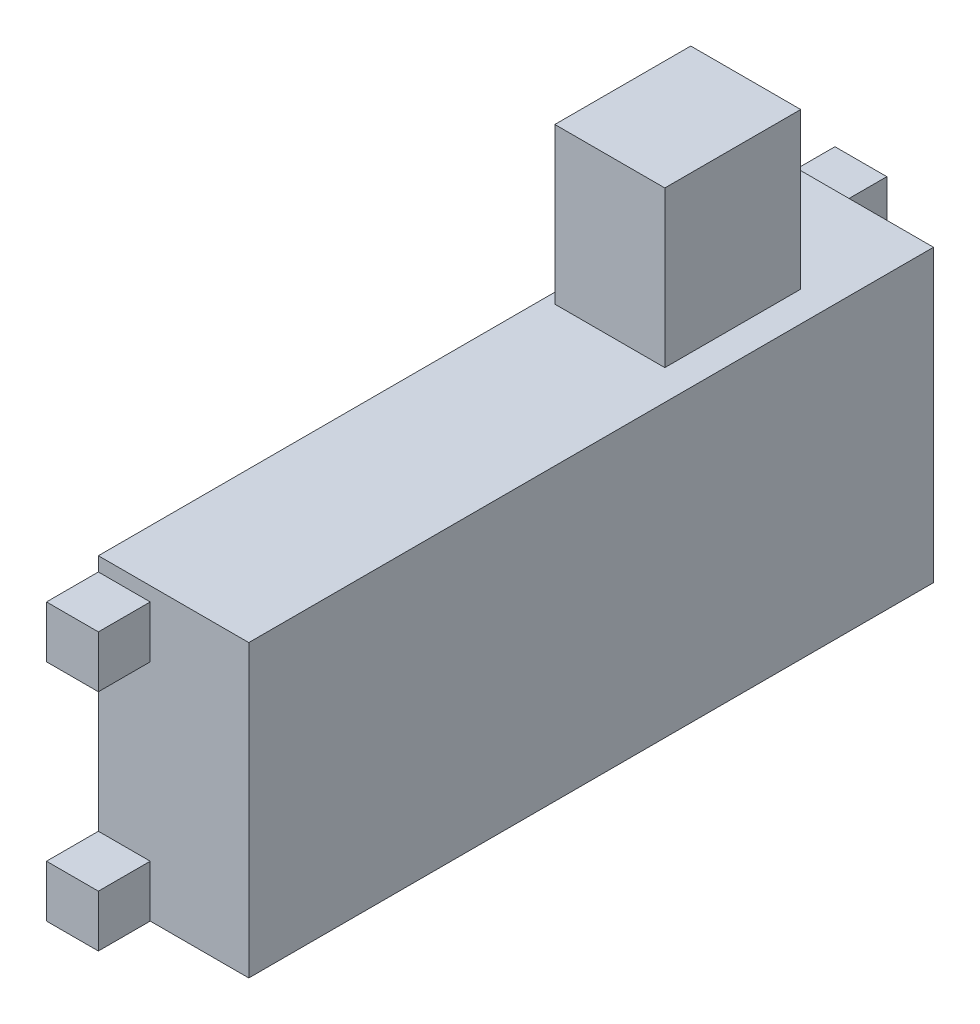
ISO-10303-21;
HEADER;
FILE_DESCRIPTION(('STEP AP214'),'2;1');
FILE_NAME('part.step','',(''),(''),'','','');
FILE_SCHEMA(('AUTOMOTIVE_DESIGN { 1 0 10303 214 1 1 1 1 }'));
ENDSEC;
DATA;
#1=APPLICATION_CONTEXT('core data for automotive mechanical design processes');
#2=APPLICATION_PROTOCOL_DEFINITION('international standard','automotive_design',2000,#1);
#3=PRODUCT_CONTEXT('',#1,'mechanical');
#4=PRODUCT('Part','Part','',(#3));
#5=PRODUCT_RELATED_PRODUCT_CATEGORY('part','',(#4));
#6=PRODUCT_DEFINITION_FORMATION('','',#4);
#7=PRODUCT_DEFINITION_CONTEXT('part definition',#1,'design');
#8=PRODUCT_DEFINITION('design','',#6,#7);
#9=PRODUCT_DEFINITION_SHAPE('','',#8);
#10=(LENGTH_UNIT() NAMED_UNIT(*) SI_UNIT(.MILLI.,.METRE.));
#11=(NAMED_UNIT(*) PLANE_ANGLE_UNIT() SI_UNIT($,.RADIAN.));
#12=(NAMED_UNIT(*) SI_UNIT($,.STERADIAN.) SOLID_ANGLE_UNIT());
#13=UNCERTAINTY_MEASURE_WITH_UNIT(LENGTH_MEASURE(1.E-05),#10,'distance_accuracy_value','');
#14=(GEOMETRIC_REPRESENTATION_CONTEXT(3) GLOBAL_UNCERTAINTY_ASSIGNED_CONTEXT((#13)) GLOBAL_UNIT_ASSIGNED_CONTEXT((#10,
#11,#12)) REPRESENTATION_CONTEXT('',''));
#15=CARTESIAN_POINT('',(0.,0.,0.));
#16=DIRECTION('',(0.,0.,1.));
#17=DIRECTION('',(1.,0.,0.));
#18=AXIS2_PLACEMENT_3D('',#15,#16,#17);
#19=CARTESIAN_POINT('',(-1.529,4.456,46.65));
#20=DIRECTION('',(0.,0.,1.));
#21=DIRECTION('',(0.,-1.,0.));
#22=AXIS2_PLACEMENT_3D('',#19,#20,#21);
#23=PLANE('',#22);
#24=DIRECTION('',(0.,-1.,0.));
#25=VECTOR('',#24,1.);
#26=CARTESIAN_POINT('',(-0.05,3.,46.65));
#27=LINE('',#26,#25);
#28=CARTESIAN_POINT('',(-0.0499999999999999,1.6,46.65));
#29=VERTEX_POINT('',#28);
#30=CARTESIAN_POINT('',(-0.0499999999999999,4.4,46.65));
#31=VERTEX_POINT('',#30);
#32=EDGE_CURVE('E234',#29,#31,#27,.F.);
#33=ORIENTED_EDGE('',*,*,#32,.T.);
#34=DIRECTION('',(-1.,0.,0.));
#35=VECTOR('',#34,1.);
#36=CARTESIAN_POINT('',(-0.775,4.4,46.65));
#37=LINE('',#36,#35);
#38=CARTESIAN_POINT('',(-1.5,4.4,46.65));
#39=VERTEX_POINT('',#38);
#40=EDGE_CURVE('E265',#39,#31,#37,.F.);
#41=ORIENTED_EDGE('',*,*,#40,.F.);
#42=DIRECTION('',(0.,-1.,0.));
#43=VECTOR('',#42,1.);
#44=CARTESIAN_POINT('',(-1.5,3.,46.65));
#45=LINE('',#44,#43);
#46=CARTESIAN_POINT('',(-1.5,4.264351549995,46.65));
#47=VERTEX_POINT('',#46);
#48=EDGE_CURVE('E267',#47,#39,#45,.F.);
#49=ORIENTED_EDGE('',*,*,#48,.F.);
#50=DIRECTION('',(1.,0.,0.));
#51=VECTOR('',#50,1.);
#52=CARTESIAN_POINT('',(-0.775,4.264351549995,46.65));
#53=LINE('',#52,#51);
#54=CARTESIAN_POINT('',(-1.,4.264351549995,46.65));
#55=VERTEX_POINT('',#54);
#56=EDGE_CURVE('E270',#55,#47,#53,.F.);
#57=ORIENTED_EDGE('',*,*,#56,.F.);
#58=DIRECTION('',(0.,-1.,0.));
#59=VECTOR('',#58,1.);
#60=CARTESIAN_POINT('',(-1.,2.9321757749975,46.65));
#61=LINE('',#60,#59);
#62=CARTESIAN_POINT('',(-1.,3.764351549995,46.65));
#63=VERTEX_POINT('',#62);
#64=EDGE_CURVE('E244',#55,#63,#61,.T.);
#65=ORIENTED_EDGE('',*,*,#64,.T.);
#66=DIRECTION('',(-1.,0.,0.));
#67=VECTOR('',#66,1.);
#68=CARTESIAN_POINT('',(-0.775,3.764351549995,46.65));
#69=LINE('',#68,#67);
#70=CARTESIAN_POINT('',(-1.5,3.764351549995,46.65));
#71=VERTEX_POINT('',#70);
#72=EDGE_CURVE('E164',#71,#63,#69,.F.);
#73=ORIENTED_EDGE('',*,*,#72,.F.);
#74=DIRECTION('',(0.,-1.,0.));
#75=VECTOR('',#74,1.);
#76=CARTESIAN_POINT('',(-1.5,3.,46.65));
#77=LINE('',#76,#75);
#78=CARTESIAN_POINT('',(-1.5,2.1,46.65));
#79=VERTEX_POINT('',#78);
#80=EDGE_CURVE('E167',#79,#71,#77,.F.);
#81=ORIENTED_EDGE('',*,*,#80,.F.);
#82=DIRECTION('',(1.,0.,0.));
#83=VECTOR('',#82,1.);
#84=CARTESIAN_POINT('',(-0.775,2.1,46.65));
#85=LINE('',#84,#83);
#86=CARTESIAN_POINT('',(-1.,2.1,46.65));
#87=VERTEX_POINT('',#86);
#88=EDGE_CURVE('E20',#87,#79,#85,.F.);
#89=ORIENTED_EDGE('',*,*,#88,.F.);
#90=DIRECTION('',(0.,-1.,0.));
#91=VECTOR('',#90,1.);
#92=CARTESIAN_POINT('',(-1.,2.9321757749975,46.65));
#93=LINE('',#92,#91);
#94=CARTESIAN_POINT('',(-1.,1.6,46.65));
#95=VERTEX_POINT('',#94);
#96=EDGE_CURVE('E242',#87,#95,#93,.T.);
#97=ORIENTED_EDGE('',*,*,#96,.T.);
#98=DIRECTION('',(1.,0.,0.));
#99=VECTOR('',#98,1.);
#100=CARTESIAN_POINT('',(-0.775,1.6,46.65));
#101=LINE('',#100,#99);
#102=EDGE_CURVE('E263',#29,#95,#101,.F.);
#103=ORIENTED_EDGE('',*,*,#102,.F.);
#104=EDGE_LOOP('',(#33,#41,#49,#57,#65,#73,#81,#89,#97,#103));
#105=FACE_BOUND('',#104,.T.);
#106=ADVANCED_FACE('F16',(#105),#23,.T.);
#107=CARTESIAN_POINT('',(-1.529,1.544,40.05));
#108=DIRECTION('',(0.,0.,-1.));
#109=DIRECTION('',(0.,1.,0.));
#110=AXIS2_PLACEMENT_3D('',#107,#108,#109);
#111=PLANE('',#110);
#112=DIRECTION('',(0.,1.,0.));
#113=VECTOR('',#112,1.);
#114=CARTESIAN_POINT('',(-1.5,3.,40.05));
#115=LINE('',#114,#113);
#116=CARTESIAN_POINT('',(-1.5,3.764351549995,40.05));
#117=VERTEX_POINT('',#116);
#118=CARTESIAN_POINT('',(-1.5,2.1,40.05));
#119=VERTEX_POINT('',#118);
#120=EDGE_CURVE('E248',#117,#119,#115,.F.);
#121=ORIENTED_EDGE('',*,*,#120,.F.);
#122=DIRECTION('',(1.,0.,0.));
#123=VECTOR('',#122,1.);
#124=CARTESIAN_POINT('',(-0.775,3.764351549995,40.05));
#125=LINE('',#124,#123);
#126=CARTESIAN_POINT('',(-1.,3.764351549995,40.05));
#127=VERTEX_POINT('',#126);
#128=EDGE_CURVE('E251',#127,#117,#125,.F.);
#129=ORIENTED_EDGE('',*,*,#128,.F.);
#130=DIRECTION('',(0.,1.,0.));
#131=VECTOR('',#130,1.);
#132=CARTESIAN_POINT('',(-1.,2.9321757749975,40.05));
#133=LINE('',#132,#131);
#134=CARTESIAN_POINT('',(-1.,4.264351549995,40.05));
#135=VERTEX_POINT('',#134);
#136=EDGE_CURVE('E236',#127,#135,#133,.T.);
#137=ORIENTED_EDGE('',*,*,#136,.T.);
#138=DIRECTION('',(-1.,0.,0.));
#139=VECTOR('',#138,1.);
#140=CARTESIAN_POINT('',(-0.775,4.264351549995,40.05));
#141=LINE('',#140,#139);
#142=CARTESIAN_POINT('',(-1.5,4.264351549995,40.05));
#143=VERTEX_POINT('',#142);
#144=EDGE_CURVE('E254',#143,#135,#141,.F.);
#145=ORIENTED_EDGE('',*,*,#144,.F.);
#146=DIRECTION('',(0.,1.,0.));
#147=VECTOR('',#146,1.);
#148=CARTESIAN_POINT('',(-1.5,3.,40.05));
#149=LINE('',#148,#147);
#150=CARTESIAN_POINT('',(-1.5,4.4,40.05));
#151=VERTEX_POINT('',#150);
#152=EDGE_CURVE('E256',#151,#143,#149,.F.);
#153=ORIENTED_EDGE('',*,*,#152,.F.);
#154=DIRECTION('',(1.,0.,0.));
#155=VECTOR('',#154,1.);
#156=CARTESIAN_POINT('',(-0.775,4.4,40.05));
#157=LINE('',#156,#155);
#158=CARTESIAN_POINT('',(-0.0499999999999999,4.4,40.05));
#159=VERTEX_POINT('',#158);
#160=EDGE_CURVE('E258',#159,#151,#157,.F.);
#161=ORIENTED_EDGE('',*,*,#160,.F.);
#162=DIRECTION('',(0.,1.,0.));
#163=VECTOR('',#162,1.);
#164=CARTESIAN_POINT('',(-0.05,3.,40.05));
#165=LINE('',#164,#163);
#166=CARTESIAN_POINT('',(-0.0499999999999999,1.6,40.05));
#167=VERTEX_POINT('',#166);
#168=EDGE_CURVE('E231',#159,#167,#165,.F.);
#169=ORIENTED_EDGE('',*,*,#168,.T.);
#170=DIRECTION('',(-1.,0.,0.));
#171=VECTOR('',#170,1.);
#172=CARTESIAN_POINT('',(-0.775,1.6,40.05));
#173=LINE('',#172,#171);
#174=CARTESIAN_POINT('',(-1.,1.6,40.05));
#175=VERTEX_POINT('',#174);
#176=EDGE_CURVE('E261',#175,#167,#173,.F.);
#177=ORIENTED_EDGE('',*,*,#176,.F.);
#178=DIRECTION('',(0.,1.,0.));
#179=VECTOR('',#178,1.);
#180=CARTESIAN_POINT('',(-1.,2.9321757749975,40.05));
#181=LINE('',#180,#179);
#182=CARTESIAN_POINT('',(-1.,2.1,40.05));
#183=VERTEX_POINT('',#182);
#184=EDGE_CURVE('E239',#175,#183,#181,.T.);
#185=ORIENTED_EDGE('',*,*,#184,.T.);
#186=DIRECTION('',(-1.,0.,0.));
#187=VECTOR('',#186,1.);
#188=CARTESIAN_POINT('',(-0.775,2.1,40.05));
#189=LINE('',#188,#187);
#190=EDGE_CURVE('E246',#119,#183,#189,.F.);
#191=ORIENTED_EDGE('',*,*,#190,.F.);
#192=EDGE_LOOP('',(#121,#129,#137,#145,#153,#161,#169,#177,#185,#191));
#193=FACE_BOUND('',#192,.T.);
#194=ADVANCED_FACE('F371',(#193),#111,.T.);
#195=CARTESIAN_POINT('',(-0.3188,5.9,42.3762));
#196=DIRECTION('',(0.,1.,0.));
#197=DIRECTION('',(0.,0.,-1.));
#198=AXIS2_PLACEMENT_3D('',#195,#196,#197);
#199=PLANE('',#198);
#200=DIRECTION('',(1.,0.,0.));
#201=VECTOR('',#200,1.);
#202=CARTESIAN_POINT('',(-0.87,5.9,41.04));
#203=LINE('',#202,#201);
#204=CARTESIAN_POINT('',(-0.34,5.9,41.04));
#205=VERTEX_POINT('',#204);
#206=CARTESIAN_POINT('',(-1.4,5.9,41.04));
#207=VERTEX_POINT('',#206);
#208=EDGE_CURVE('E219',#205,#207,#203,.F.);
#209=ORIENTED_EDGE('',*,*,#208,.T.);
#210=DIRECTION('',(0.,0.,-1.));
#211=VECTOR('',#210,1.);
#212=CARTESIAN_POINT('',(-1.4,5.9,41.695));
#213=LINE('',#212,#211);
#214=CARTESIAN_POINT('',(-1.4,5.9,42.35));
#215=VERTEX_POINT('',#214);
#216=EDGE_CURVE('E213',#207,#215,#213,.F.);
#217=ORIENTED_EDGE('',*,*,#216,.T.);
#218=DIRECTION('',(-1.,0.,0.));
#219=VECTOR('',#218,1.);
#220=CARTESIAN_POINT('',(-0.87,5.9,42.35));
#221=LINE('',#220,#219);
#222=CARTESIAN_POINT('',(-0.34,5.9,42.35));
#223=VERTEX_POINT('',#222);
#224=EDGE_CURVE('E229',#215,#223,#221,.F.);
#225=ORIENTED_EDGE('',*,*,#224,.T.);
#226=DIRECTION('',(0.,0.,1.));
#227=VECTOR('',#226,1.);
#228=CARTESIAN_POINT('',(-0.34,5.9,41.695));
#229=LINE('',#228,#227);
#230=EDGE_CURVE('E224',#223,#205,#229,.F.);
#231=ORIENTED_EDGE('',*,*,#230,.T.);
#232=EDGE_LOOP('',(#209,#217,#225,#231));
#233=FACE_BOUND('',#232,.T.);
#234=ADVANCED_FACE('F464',(#233),#199,.T.);
#235=CARTESIAN_POINT('',(-1.,1.546712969,47.302));
#236=DIRECTION('',(-1.,0.,0.));
#237=DIRECTION('',(0.,1.,0.));
#238=AXIS2_PLACEMENT_3D('',#235,#236,#237);
#239=PLANE('',#238);
#240=DIRECTION('',(0.,1.,0.));
#241=VECTOR('',#240,1.);
#242=CARTESIAN_POINT('',(-1.,4.0143515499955,47.15));
#243=LINE('',#242,#241);
#244=CARTESIAN_POINT('',(-1.,4.264351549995,47.15));
#245=VERTEX_POINT('',#244);
#246=CARTESIAN_POINT('',(-1.,3.764351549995,47.15));
#247=VERTEX_POINT('',#246);
#248=EDGE_CURVE('E203',#245,#247,#243,.F.);
#249=ORIENTED_EDGE('',*,*,#248,.T.);
#250=DIRECTION('',(0.,0.,1.));
#251=VECTOR('',#250,1.);
#252=CARTESIAN_POINT('',(-1.,3.764351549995,46.9));
#253=LINE('',#252,#251);
#254=EDGE_CURVE('E192',#247,#63,#253,.F.);
#255=ORIENTED_EDGE('',*,*,#254,.T.);
#256=ORIENTED_EDGE('',*,*,#64,.F.);
#257=DIRECTION('',(0.,0.,-1.));
#258=VECTOR('',#257,1.);
#259=CARTESIAN_POINT('',(-1.,4.264351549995,46.9));
#260=LINE('',#259,#258);
#261=EDGE_CURVE('E208',#55,#245,#260,.F.);
#262=ORIENTED_EDGE('',*,*,#261,.T.);
#263=EDGE_LOOP('',(#249,#255,#256,#262));
#264=FACE_BOUND('',#263,.T.);
#265=ADVANCED_FACE('F279',(#264),#239,.F.);
#266=CARTESIAN_POINT('',(-1.,1.546712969,47.302));
#267=DIRECTION('',(-1.,0.,0.));
#268=DIRECTION('',(0.,1.,0.));
#269=AXIS2_PLACEMENT_3D('',#266,#267,#268);
#270=PLANE('',#269);
#271=DIRECTION('',(0.,1.,0.));
#272=VECTOR('',#271,1.);
#273=CARTESIAN_POINT('',(-1.,1.85,47.15));
#274=LINE('',#273,#272);
#275=CARTESIAN_POINT('',(-1.,2.1,47.15));
#276=VERTEX_POINT('',#275);
#277=CARTESIAN_POINT('',(-1.,1.6,47.15));
#278=VERTEX_POINT('',#277);
#279=EDGE_CURVE('E194',#276,#278,#274,.F.);
#280=ORIENTED_EDGE('',*,*,#279,.T.);
#281=DIRECTION('',(0.,0.,1.));
#282=VECTOR('',#281,1.);
#283=CARTESIAN_POINT('',(-1.,1.6,43.35));
#284=LINE('',#283,#282);
#285=EDGE_CURVE('E337',#278,#95,#284,.F.);
#286=ORIENTED_EDGE('',*,*,#285,.T.);
#287=ORIENTED_EDGE('',*,*,#96,.F.);
#288=DIRECTION('',(0.,0.,-1.));
#289=VECTOR('',#288,1.);
#290=CARTESIAN_POINT('',(-1.,2.1,46.9));
#291=LINE('',#290,#289);
#292=EDGE_CURVE('E188',#87,#276,#291,.F.);
#293=ORIENTED_EDGE('',*,*,#292,.T.);
#294=EDGE_LOOP('',(#280,#286,#287,#293));
#295=FACE_BOUND('',#294,.T.);
#296=ADVANCED_FACE('F343',(#295),#270,.F.);
#297=CARTESIAN_POINT('',(-1.,1.546712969,47.302));
#298=DIRECTION('',(-1.,0.,0.));
#299=DIRECTION('',(0.,1.,0.));
#300=AXIS2_PLACEMENT_3D('',#297,#298,#299);
#301=PLANE('',#300);
#302=DIRECTION('',(0.,-1.,0.));
#303=VECTOR('',#302,1.);
#304=CARTESIAN_POINT('',(-1.,1.85,39.55));
#305=LINE('',#304,#303);
#306=CARTESIAN_POINT('',(-1.,1.6,39.55));
#307=VERTEX_POINT('',#306);
#308=CARTESIAN_POINT('',(-1.,2.1,39.55));
#309=VERTEX_POINT('',#308);
#310=EDGE_CURVE('E327',#307,#309,#305,.F.);
#311=ORIENTED_EDGE('',*,*,#310,.T.);
#312=DIRECTION('',(0.,0.,-1.));
#313=VECTOR('',#312,1.);
#314=CARTESIAN_POINT('',(-1.,2.1,39.8));
#315=LINE('',#314,#313);
#316=EDGE_CURVE('E321',#309,#183,#315,.F.);
#317=ORIENTED_EDGE('',*,*,#316,.T.);
#318=ORIENTED_EDGE('',*,*,#184,.F.);
#319=DIRECTION('',(0.,0.,1.));
#320=VECTOR('',#319,1.);
#321=CARTESIAN_POINT('',(-1.,1.6,43.35));
#322=LINE('',#321,#320);
#323=EDGE_CURVE('E332',#175,#307,#322,.F.);
#324=ORIENTED_EDGE('',*,*,#323,.T.);
#325=EDGE_LOOP('',(#311,#317,#318,#324));
#326=FACE_BOUND('',#325,.T.);
#327=ADVANCED_FACE('F415',(#326),#301,.F.);
#328=CARTESIAN_POINT('',(-1.,1.546712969,47.302));
#329=DIRECTION('',(-1.,0.,0.));
#330=DIRECTION('',(0.,1.,0.));
#331=AXIS2_PLACEMENT_3D('',#328,#329,#330);
#332=PLANE('',#331);
#333=DIRECTION('',(0.,-1.,0.));
#334=VECTOR('',#333,1.);
#335=CARTESIAN_POINT('',(-1.,4.0143515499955,39.55));
#336=LINE('',#335,#334);
#337=CARTESIAN_POINT('',(-1.,3.764351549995,39.55));
#338=VERTEX_POINT('',#337);
#339=CARTESIAN_POINT('',(-1.,4.264351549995,39.55));
#340=VERTEX_POINT('',#339);
#341=EDGE_CURVE('E314',#338,#340,#336,.F.);
#342=ORIENTED_EDGE('',*,*,#341,.T.);
#343=DIRECTION('',(0.,0.,-1.));
#344=VECTOR('',#343,1.);
#345=CARTESIAN_POINT('',(-1.,4.264351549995,39.8));
#346=LINE('',#345,#344);
#347=EDGE_CURVE('E310',#340,#135,#346,.F.);
#348=ORIENTED_EDGE('',*,*,#347,.T.);
#349=ORIENTED_EDGE('',*,*,#136,.F.);
#350=DIRECTION('',(0.,0.,1.));
#351=VECTOR('',#350,1.);
#352=CARTESIAN_POINT('',(-1.,3.764351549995,39.8));
#353=LINE('',#352,#351);
#354=EDGE_CURVE('E319',#127,#338,#353,.F.);
#355=ORIENTED_EDGE('',*,*,#354,.T.);
#356=EDGE_LOOP('',(#342,#348,#349,#355));
#357=FACE_BOUND('',#356,.T.);
#358=ADVANCED_FACE('F376',(#357),#332,.F.);
#359=CARTESIAN_POINT('',(-0.05,1.544,46.782));
#360=DIRECTION('',(1.,0.,0.));
#361=DIRECTION('',(0.,0.,-1.));
#362=AXIS2_PLACEMENT_3D('',#359,#360,#361);
#363=PLANE('',#362);
#364=DIRECTION('',(0.,0.,-1.));
#365=VECTOR('',#364,1.);
#366=CARTESIAN_POINT('',(-0.0499999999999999,4.4,43.35));
#367=LINE('',#366,#365);
#368=EDGE_CURVE('E307',#159,#31,#367,.F.);
#369=ORIENTED_EDGE('',*,*,#368,.T.);
#370=ORIENTED_EDGE('',*,*,#32,.F.);
#371=DIRECTION('',(0.,0.,1.));
#372=VECTOR('',#371,1.);
#373=CARTESIAN_POINT('',(-0.0499999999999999,1.6,43.35));
#374=LINE('',#373,#372);
#375=EDGE_CURVE('E334',#29,#167,#374,.F.);
#376=ORIENTED_EDGE('',*,*,#375,.T.);
#377=ORIENTED_EDGE('',*,*,#168,.F.);
#378=EDGE_LOOP('',(#369,#370,#376,#377));
#379=FACE_BOUND('',#378,.T.);
#380=ADVANCED_FACE('F412',(#379),#363,.T.);
#381=CARTESIAN_POINT('',(-1.4212,4.37,42.35));
#382=DIRECTION('',(0.,0.,1.));
#383=DIRECTION('',(1.,0.,0.));
#384=AXIS2_PLACEMENT_3D('',#381,#382,#383);
#385=PLANE('',#384);
#386=ORIENTED_EDGE('',*,*,#224,.F.);
#387=DIRECTION('',(0.,1.,0.));
#388=VECTOR('',#387,1.);
#389=CARTESIAN_POINT('',(-1.4,5.15,42.35));
#390=LINE('',#389,#388);
#391=CARTESIAN_POINT('',(-1.4,4.4,42.35));
#392=VERTEX_POINT('',#391);
#393=EDGE_CURVE('E210',#215,#392,#390,.F.);
#394=ORIENTED_EDGE('',*,*,#393,.T.);
#395=DIRECTION('',(-1.,0.,0.));
#396=VECTOR('',#395,1.);
#397=CARTESIAN_POINT('',(-0.775,4.4,42.35));
#398=LINE('',#397,#396);
#399=CARTESIAN_POINT('',(-0.34,4.4,42.35));
#400=VERTEX_POINT('',#399);
#401=EDGE_CURVE('E304',#392,#400,#398,.F.);
#402=ORIENTED_EDGE('',*,*,#401,.T.);
#403=DIRECTION('',(0.,-1.,0.));
#404=VECTOR('',#403,1.);
#405=CARTESIAN_POINT('',(-0.34,5.15,42.35));
#406=LINE('',#405,#404);
#407=EDGE_CURVE('E226',#400,#223,#406,.F.);
#408=ORIENTED_EDGE('',*,*,#407,.T.);
#409=EDGE_LOOP('',(#386,#394,#402,#408));
#410=FACE_BOUND('',#409,.T.);
#411=ADVANCED_FACE('F449',(#410),#385,.T.);
#412=CARTESIAN_POINT('',(-0.34,4.37,42.3762));
#413=DIRECTION('',(1.,0.,0.));
#414=DIRECTION('',(0.,0.,-1.));
#415=AXIS2_PLACEMENT_3D('',#412,#413,#414);
#416=PLANE('',#415);
#417=ORIENTED_EDGE('',*,*,#230,.F.);
#418=ORIENTED_EDGE('',*,*,#407,.F.);
#419=DIRECTION('',(0.,0.,1.));
#420=VECTOR('',#419,1.);
#421=CARTESIAN_POINT('',(-0.34,4.4,43.35));
#422=LINE('',#421,#420);
#423=CARTESIAN_POINT('',(-0.34,4.4,41.04));
#424=VERTEX_POINT('',#423);
#425=EDGE_CURVE('E301',#400,#424,#422,.F.);
#426=ORIENTED_EDGE('',*,*,#425,.T.);
#427=DIRECTION('',(0.,-1.,0.));
#428=VECTOR('',#427,1.);
#429=CARTESIAN_POINT('',(-0.34,5.15,41.04));
#430=LINE('',#429,#428);
#431=EDGE_CURVE('E221',#424,#205,#430,.F.);
#432=ORIENTED_EDGE('',*,*,#431,.T.);
#433=EDGE_LOOP('',(#417,#418,#426,#432));
#434=FACE_BOUND('',#433,.T.);
#435=ADVANCED_FACE('F445',(#434),#416,.T.);
#436=CARTESIAN_POINT('',(-0.3188,4.37,41.04));
#437=DIRECTION('',(0.,0.,-1.));
#438=DIRECTION('',(-1.,0.,0.));
#439=AXIS2_PLACEMENT_3D('',#436,#437,#438);
#440=PLANE('',#439);
#441=ORIENTED_EDGE('',*,*,#208,.F.);
#442=ORIENTED_EDGE('',*,*,#431,.F.);
#443=DIRECTION('',(1.,0.,0.));
#444=VECTOR('',#443,1.);
#445=CARTESIAN_POINT('',(-0.775,4.4,41.04));
#446=LINE('',#445,#444);
#447=CARTESIAN_POINT('',(-1.4,4.4,41.04));
#448=VERTEX_POINT('',#447);
#449=EDGE_CURVE('E295',#424,#448,#446,.F.);
#450=ORIENTED_EDGE('',*,*,#449,.T.);
#451=DIRECTION('',(0.,-1.,0.));
#452=VECTOR('',#451,1.);
#453=CARTESIAN_POINT('',(-1.4,5.15,41.04));
#454=LINE('',#453,#452);
#455=EDGE_CURVE('E216',#448,#207,#454,.F.);
#456=ORIENTED_EDGE('',*,*,#455,.T.);
#457=EDGE_LOOP('',(#441,#442,#450,#456));
#458=FACE_BOUND('',#457,.T.);
#459=ADVANCED_FACE('F441',(#458),#440,.T.);
#460=CARTESIAN_POINT('',(-1.4,4.37,41.0138));
#461=DIRECTION('',(-1.,0.,0.));
#462=DIRECTION('',(0.,0.,1.));
#463=AXIS2_PLACEMENT_3D('',#460,#461,#462);
#464=PLANE('',#463);
#465=ORIENTED_EDGE('',*,*,#216,.F.);
#466=ORIENTED_EDGE('',*,*,#455,.F.);
#467=DIRECTION('',(0.,0.,-1.));
#468=VECTOR('',#467,1.);
#469=CARTESIAN_POINT('',(-1.4,4.4,43.35));
#470=LINE('',#469,#468);
#471=EDGE_CURVE('E291',#448,#392,#470,.F.);
#472=ORIENTED_EDGE('',*,*,#471,.T.);
#473=ORIENTED_EDGE('',*,*,#393,.F.);
#474=EDGE_LOOP('',(#465,#466,#472,#473));
#475=FACE_BOUND('',#474,.T.);
#476=ADVANCED_FACE('F438',(#475),#464,.T.);
#477=CARTESIAN_POINT('',(-0.9893779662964,4.264351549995,47.1606220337));
#478=DIRECTION('',(0.,1.,0.));
#479=DIRECTION('',(0.,0.,-1.));
#480=AXIS2_PLACEMENT_3D('',#477,#478,#479);
#481=PLANE('',#480);
#482=DIRECTION('',(-1.,0.,0.));
#483=VECTOR('',#482,1.);
#484=CARTESIAN_POINT('',(-1.2500000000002,4.264351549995,47.15));
#485=LINE('',#484,#483);
#486=CARTESIAN_POINT('',(-1.5,4.264351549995,47.15));
#487=VERTEX_POINT('',#486);
#488=EDGE_CURVE('E205',#487,#245,#485,.F.);
#489=ORIENTED_EDGE('',*,*,#488,.T.);
#490=ORIENTED_EDGE('',*,*,#261,.F.);
#491=ORIENTED_EDGE('',*,*,#56,.T.);
#492=DIRECTION('',(0.,0.,1.));
#493=VECTOR('',#492,1.);
#494=CARTESIAN_POINT('',(-1.5,4.264351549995,43.35));
#495=LINE('',#494,#493);
#496=EDGE_CURVE('E289',#47,#487,#495,.T.);
#497=ORIENTED_EDGE('',*,*,#496,.T.);
#498=EDGE_LOOP('',(#489,#490,#491,#497));
#499=FACE_BOUND('',#498,.T.);
#500=ADVANCED_FACE('F287',(#499),#481,.T.);
#501=CARTESIAN_POINT('',(-0.9893779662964,3.753729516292,47.15));
#502=DIRECTION('',(0.,0.,1.));
#503=DIRECTION('',(0.,1.,0.));
#504=AXIS2_PLACEMENT_3D('',#501,#502,#503);
#505=PLANE('',#504);
#506=ORIENTED_EDGE('',*,*,#248,.F.);
#507=ORIENTED_EDGE('',*,*,#488,.F.);
#508=DIRECTION('',(0.,-1.,0.));
#509=VECTOR('',#508,1.);
#510=CARTESIAN_POINT('',(-1.5,3.,47.15));
#511=LINE('',#510,#509);
#512=CARTESIAN_POINT('',(-1.5,3.764351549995,47.15));
#513=VERTEX_POINT('',#512);
#514=EDGE_CURVE('E290',#487,#513,#511,.T.);
#515=ORIENTED_EDGE('',*,*,#514,.T.);
#516=DIRECTION('',(-1.,0.,0.));
#517=VECTOR('',#516,1.);
#518=CARTESIAN_POINT('',(-1.2500000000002,3.764351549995,47.15));
#519=LINE('',#518,#517);
#520=EDGE_CURVE('E197',#513,#247,#519,.F.);
#521=ORIENTED_EDGE('',*,*,#520,.T.);
#522=EDGE_LOOP('',(#506,#507,#515,#521));
#523=FACE_BOUND('',#522,.T.);
#524=ADVANCED_FACE('F282',(#523),#505,.T.);
#525=CARTESIAN_POINT('',(-0.9893779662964,3.764351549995,46.6393779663));
#526=DIRECTION('',(0.,-1.,0.));
#527=DIRECTION('',(0.,0.,1.));
#528=AXIS2_PLACEMENT_3D('',#525,#526,#527);
#529=PLANE('',#528);
#530=ORIENTED_EDGE('',*,*,#520,.F.);
#531=DIRECTION('',(0.,0.,-1.));
#532=VECTOR('',#531,1.);
#533=CARTESIAN_POINT('',(-1.5,3.764351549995,43.35));
#534=LINE('',#533,#532);
#535=EDGE_CURVE('E184',#513,#71,#534,.T.);
#536=ORIENTED_EDGE('',*,*,#535,.T.);
#537=ORIENTED_EDGE('',*,*,#72,.T.);
#538=ORIENTED_EDGE('',*,*,#254,.F.);
#539=EDGE_LOOP('',(#530,#536,#537,#538));
#540=FACE_BOUND('',#539,.T.);
#541=ADVANCED_FACE('F275',(#540),#529,.T.);
#542=CARTESIAN_POINT('',(-0.9893779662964,2.1,47.1606220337));
#543=DIRECTION('',(0.,1.,0.));
#544=DIRECTION('',(0.,0.,-1.));
#545=AXIS2_PLACEMENT_3D('',#542,#543,#544);
#546=PLANE('',#545);
#547=DIRECTION('',(-1.,0.,0.));
#548=VECTOR('',#547,1.);
#549=CARTESIAN_POINT('',(-1.2500000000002,2.1,47.15));
#550=LINE('',#549,#548);
#551=CARTESIAN_POINT('',(-1.5,2.1,47.15));
#552=VERTEX_POINT('',#551);
#553=EDGE_CURVE('E189',#552,#276,#550,.F.);
#554=ORIENTED_EDGE('',*,*,#553,.T.);
#555=ORIENTED_EDGE('',*,*,#292,.F.);
#556=ORIENTED_EDGE('',*,*,#88,.T.);
#557=DIRECTION('',(0.,0.,1.));
#558=VECTOR('',#557,1.);
#559=CARTESIAN_POINT('',(-1.5,2.1,43.35));
#560=LINE('',#559,#558);
#561=EDGE_CURVE('E177',#79,#552,#560,.T.);
#562=ORIENTED_EDGE('',*,*,#561,.T.);
#563=EDGE_LOOP('',(#554,#555,#556,#562));
#564=FACE_BOUND('',#563,.T.);
#565=ADVANCED_FACE('F187',(#564),#546,.T.);
#566=CARTESIAN_POINT('',(-0.9893779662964,1.589377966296,47.15));
#567=DIRECTION('',(0.,0.,1.));
#568=DIRECTION('',(0.,1.,0.));
#569=AXIS2_PLACEMENT_3D('',#566,#567,#568);
#570=PLANE('',#569);
#571=ORIENTED_EDGE('',*,*,#279,.F.);
#572=ORIENTED_EDGE('',*,*,#553,.F.);
#573=DIRECTION('',(0.,-1.,0.));
#574=VECTOR('',#573,1.);
#575=CARTESIAN_POINT('',(-1.5,3.,47.15));
#576=LINE('',#575,#574);
#577=CARTESIAN_POINT('',(-1.5,1.6,47.15));
#578=VERTEX_POINT('',#577);
#579=EDGE_CURVE('E181',#552,#578,#576,.T.);
#580=ORIENTED_EDGE('',*,*,#579,.T.);
#581=DIRECTION('',(-1.,0.,0.));
#582=VECTOR('',#581,1.);
#583=CARTESIAN_POINT('',(-0.775,1.6,47.15));
#584=LINE('',#583,#582);
#585=EDGE_CURVE('E340',#578,#278,#584,.F.);
#586=ORIENTED_EDGE('',*,*,#585,.T.);
#587=EDGE_LOOP('',(#571,#572,#580,#586));
#588=FACE_BOUND('',#587,.T.);
#589=ADVANCED_FACE('F350',(#588),#570,.T.);
#590=CARTESIAN_POINT('',(-1.529,1.6,47.302));
#591=DIRECTION('',(0.,-1.,0.));
#592=DIRECTION('',(0.,0.,-1.));
#593=AXIS2_PLACEMENT_3D('',#590,#591,#592);
#594=PLANE('',#593);
#595=ORIENTED_EDGE('',*,*,#323,.F.);
#596=ORIENTED_EDGE('',*,*,#176,.T.);
#597=ORIENTED_EDGE('',*,*,#375,.F.);
#598=ORIENTED_EDGE('',*,*,#102,.T.);
#599=ORIENTED_EDGE('',*,*,#285,.F.);
#600=ORIENTED_EDGE('',*,*,#585,.F.);
#601=DIRECTION('',(0.,0.,-1.));
#602=VECTOR('',#601,1.);
#603=CARTESIAN_POINT('',(-1.5,1.6,43.35));
#604=LINE('',#603,#602);
#605=CARTESIAN_POINT('',(-1.5,1.6,39.55));
#606=VERTEX_POINT('',#605);
#607=EDGE_CURVE('E351',#578,#606,#604,.T.);
#608=ORIENTED_EDGE('',*,*,#607,.T.);
#609=DIRECTION('',(-1.,0.,0.));
#610=VECTOR('',#609,1.);
#611=CARTESIAN_POINT('',(-1.2500000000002,1.6,39.55));
#612=LINE('',#611,#610);
#613=EDGE_CURVE('E329',#606,#307,#612,.F.);
#614=ORIENTED_EDGE('',*,*,#613,.T.);
#615=EDGE_LOOP('',(#595,#596,#597,#598,#599,#600,#608,#614));
#616=FACE_BOUND('',#615,.T.);
#617=ADVANCED_FACE('F347',(#616),#594,.T.);
#618=CARTESIAN_POINT('',(-0.9893779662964,2.110622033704,39.55));
#619=DIRECTION('',(0.,0.,-1.));
#620=DIRECTION('',(0.,-1.,0.));
#621=AXIS2_PLACEMENT_3D('',#618,#619,#620);
#622=PLANE('',#621);
#623=ORIENTED_EDGE('',*,*,#310,.F.);
#624=ORIENTED_EDGE('',*,*,#613,.F.);
#625=DIRECTION('',(0.,1.,0.));
#626=VECTOR('',#625,1.);
#627=CARTESIAN_POINT('',(-1.5,3.,39.55));
#628=LINE('',#627,#626);
#629=CARTESIAN_POINT('',(-1.5,2.1,39.55));
#630=VERTEX_POINT('',#629);
#631=EDGE_CURVE('E353',#606,#630,#628,.T.);
#632=ORIENTED_EDGE('',*,*,#631,.T.);
#633=DIRECTION('',(-1.,0.,0.));
#634=VECTOR('',#633,1.);
#635=CARTESIAN_POINT('',(-1.2500000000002,2.1,39.55));
#636=LINE('',#635,#634);
#637=EDGE_CURVE('E324',#630,#309,#636,.F.);
#638=ORIENTED_EDGE('',*,*,#637,.T.);
#639=EDGE_LOOP('',(#623,#624,#632,#638));
#640=FACE_BOUND('',#639,.T.);
#641=ADVANCED_FACE('F392',(#640),#622,.T.);
#642=CARTESIAN_POINT('',(-0.9893779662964,2.1,40.0606220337));
#643=DIRECTION('',(0.,1.,0.));
#644=DIRECTION('',(0.,0.,-1.));
#645=AXIS2_PLACEMENT_3D('',#642,#643,#644);
#646=PLANE('',#645);
#647=ORIENTED_EDGE('',*,*,#637,.F.);
#648=DIRECTION('',(0.,0.,1.));
#649=VECTOR('',#648,1.);
#650=CARTESIAN_POINT('',(-1.5,2.1,43.35));
#651=LINE('',#650,#649);
#652=EDGE_CURVE('E358',#630,#119,#651,.T.);
#653=ORIENTED_EDGE('',*,*,#652,.T.);
#654=ORIENTED_EDGE('',*,*,#190,.T.);
#655=ORIENTED_EDGE('',*,*,#316,.F.);
#656=EDGE_LOOP('',(#647,#653,#654,#655));
#657=FACE_BOUND('',#656,.T.);
#658=ADVANCED_FACE('F384',(#657),#646,.T.);
#659=CARTESIAN_POINT('',(-0.9893779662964,3.764351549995,39.5393779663));
#660=DIRECTION('',(0.,-1.,0.));
#661=DIRECTION('',(0.,0.,1.));
#662=AXIS2_PLACEMENT_3D('',#659,#660,#661);
#663=PLANE('',#662);
#664=DIRECTION('',(-1.,0.,0.));
#665=VECTOR('',#664,1.);
#666=CARTESIAN_POINT('',(-1.2500000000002,3.764351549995,39.55));
#667=LINE('',#666,#665);
#668=CARTESIAN_POINT('',(-1.5,3.764351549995,39.55));
#669=VERTEX_POINT('',#668);
#670=EDGE_CURVE('E316',#669,#338,#667,.F.);
#671=ORIENTED_EDGE('',*,*,#670,.T.);
#672=ORIENTED_EDGE('',*,*,#354,.F.);
#673=ORIENTED_EDGE('',*,*,#128,.T.);
#674=DIRECTION('',(0.,0.,-1.));
#675=VECTOR('',#674,1.);
#676=CARTESIAN_POINT('',(-1.5,3.764351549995,43.35));
#677=LINE('',#676,#675);
#678=EDGE_CURVE('E361',#117,#669,#677,.T.);
#679=ORIENTED_EDGE('',*,*,#678,.T.);
#680=EDGE_LOOP('',(#671,#672,#673,#679));
#681=FACE_BOUND('',#680,.T.);
#682=ADVANCED_FACE('F382',(#681),#663,.T.);
#683=CARTESIAN_POINT('',(-0.9893779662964,4.274973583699,39.55));
#684=DIRECTION('',(0.,0.,-1.));
#685=DIRECTION('',(0.,-1.,0.));
#686=AXIS2_PLACEMENT_3D('',#683,#684,#685);
#687=PLANE('',#686);
#688=ORIENTED_EDGE('',*,*,#341,.F.);
#689=ORIENTED_EDGE('',*,*,#670,.F.);
#690=DIRECTION('',(0.,1.,0.));
#691=VECTOR('',#690,1.);
#692=CARTESIAN_POINT('',(-1.5,3.,39.55));
#693=LINE('',#692,#691);
#694=CARTESIAN_POINT('',(-1.5,4.264351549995,39.55));
#695=VERTEX_POINT('',#694);
#696=EDGE_CURVE('E364',#669,#695,#693,.T.);
#697=ORIENTED_EDGE('',*,*,#696,.T.);
#698=DIRECTION('',(-1.,0.,0.));
#699=VECTOR('',#698,1.);
#700=CARTESIAN_POINT('',(-1.2500000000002,4.264351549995,39.55));
#701=LINE('',#700,#699);
#702=EDGE_CURVE('E35',#695,#340,#701,.F.);
#703=ORIENTED_EDGE('',*,*,#702,.T.);
#704=EDGE_LOOP('',(#688,#689,#697,#703));
#705=FACE_BOUND('',#704,.T.);
#706=ADVANCED_FACE('F379',(#705),#687,.T.);
#707=CARTESIAN_POINT('',(-0.9893779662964,4.264351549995,40.0606220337));
#708=DIRECTION('',(0.,1.,0.));
#709=DIRECTION('',(0.,0.,-1.));
#710=AXIS2_PLACEMENT_3D('',#707,#708,#709);
#711=PLANE('',#710);
#712=ORIENTED_EDGE('',*,*,#702,.F.);
#713=DIRECTION('',(0.,0.,1.));
#714=VECTOR('',#713,1.);
#715=CARTESIAN_POINT('',(-1.5,4.264351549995,43.35));
#716=LINE('',#715,#714);
#717=EDGE_CURVE('E26',#695,#143,#716,.T.);
#718=ORIENTED_EDGE('',*,*,#717,.T.);
#719=ORIENTED_EDGE('',*,*,#144,.T.);
#720=ORIENTED_EDGE('',*,*,#347,.F.);
#721=EDGE_LOOP('',(#712,#718,#719,#720));
#722=FACE_BOUND('',#721,.T.);
#723=ADVANCED_FACE('F367',(#722),#711,.T.);
#724=CARTESIAN_POINT('',(-1.529,4.4,39.918));
#725=DIRECTION('',(0.,1.,0.));
#726=DIRECTION('',(0.,0.,1.));
#727=AXIS2_PLACEMENT_3D('',#724,#725,#726);
#728=PLANE('',#727);
#729=ORIENTED_EDGE('',*,*,#449,.F.);
#730=ORIENTED_EDGE('',*,*,#425,.F.);
#731=ORIENTED_EDGE('',*,*,#401,.F.);
#732=ORIENTED_EDGE('',*,*,#471,.F.);
#733=EDGE_LOOP('',(#729,#730,#731,#732));
#734=FACE_BOUND('',#733,.T.);
#735=ORIENTED_EDGE('',*,*,#368,.F.);
#736=ORIENTED_EDGE('',*,*,#160,.T.);
#737=DIRECTION('',(0.,0.,1.));
#738=VECTOR('',#737,1.);
#739=CARTESIAN_POINT('',(-1.5,4.4,43.35));
#740=LINE('',#739,#738);
#741=EDGE_CURVE('E11',#151,#39,#740,.T.);
#742=ORIENTED_EDGE('',*,*,#741,.T.);
#743=ORIENTED_EDGE('',*,*,#40,.T.);
#744=EDGE_LOOP('',(#735,#736,#742,#743));
#745=FACE_BOUND('',#744,.T.);
#746=ADVANCED_FACE('F396',(#734,#745),#728,.T.);
#747=CARTESIAN_POINT('',(-1.5,1.544,47.302));
#748=DIRECTION('',(1.,0.,0.));
#749=DIRECTION('',(0.,0.,-1.));
#750=AXIS2_PLACEMENT_3D('',#747,#748,#749);
#751=PLANE('',#750);
#752=ORIENTED_EDGE('',*,*,#152,.T.);
#753=ORIENTED_EDGE('',*,*,#717,.F.);
#754=ORIENTED_EDGE('',*,*,#696,.F.);
#755=ORIENTED_EDGE('',*,*,#678,.F.);
#756=ORIENTED_EDGE('',*,*,#120,.T.);
#757=ORIENTED_EDGE('',*,*,#652,.F.);
#758=ORIENTED_EDGE('',*,*,#631,.F.);
#759=ORIENTED_EDGE('',*,*,#607,.F.);
#760=ORIENTED_EDGE('',*,*,#579,.F.);
#761=ORIENTED_EDGE('',*,*,#561,.F.);
#762=ORIENTED_EDGE('',*,*,#80,.T.);
#763=ORIENTED_EDGE('',*,*,#535,.F.);
#764=ORIENTED_EDGE('',*,*,#514,.F.);
#765=ORIENTED_EDGE('',*,*,#496,.F.);
#766=ORIENTED_EDGE('',*,*,#48,.T.);
#767=ORIENTED_EDGE('',*,*,#741,.F.);
#768=EDGE_LOOP('',(#752,#753,#754,#755,#756,#757,#758,#759,#760,#761,#762,#763,#764,#765,#766,#767));
#769=FACE_BOUND('',#768,.T.);
#770=ADVANCED_FACE('F18',(#769),#751,.F.);
#771=CLOSED_SHELL('',(#106,#194,#234,#265,#296,#327,#358,#380,#411,#435,#459,#476,#500,#524,
#541,#565,#589,#617,#641,#658,#682,#706,#723,#746,#770));
#772=MANIFOLD_SOLID_BREP('B1',#771);
#773=ADVANCED_BREP_SHAPE_REPRESENTATION('',(#18,#772),#14);
#774=SHAPE_DEFINITION_REPRESENTATION(#9,#773);
ENDSEC;
END-ISO-10303-21;
